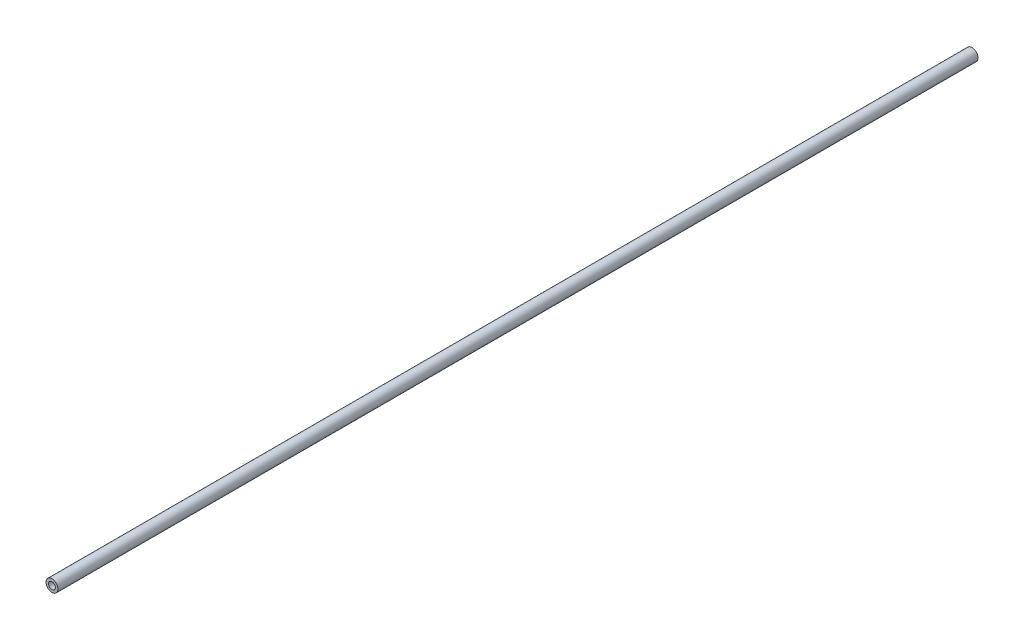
from build123d import *

# Parameters (mm, degrees)
ESQUISSE1_R      = 6
EXTRUSION1_DEPTH = 462.5


with BuildPart() as part:
    # Esquisse1 → Extrusion1 (new, symmetric)
    with BuildSketch(Plane.XY):
        with Locations(Location((0, 0, 0), (0, 0, 180))):
            Circle(ESQUISSE1_R)
    extrude(amount=EXTRUSION1_DEPTH, both=True)

    # Esquisse4 → Trou taraud_ M8x1.252 (revolve, cut)
    with BuildSketch(Plane(origin=(0, 0, -462.5), x_dir=(0, 1, 0), z_dir=(1, 0, 0))):
        Polygon((0, 0), (0, 21.792926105), (3.4, 19.75), (3.4, 0), align=None)
    trou_taraud_m8x1_252 = revolve(axis=Axis((0, 0, -468.85), (0, 0, 1)), mode=Mode.SUBTRACT)

    # Sym_trie1: Trou taraud_ M8x1.252 across plane
    add(trou_taraud_m8x1_252.mirror(Plane.XY), mode=Mode.SUBTRACT)


solid = part.part
